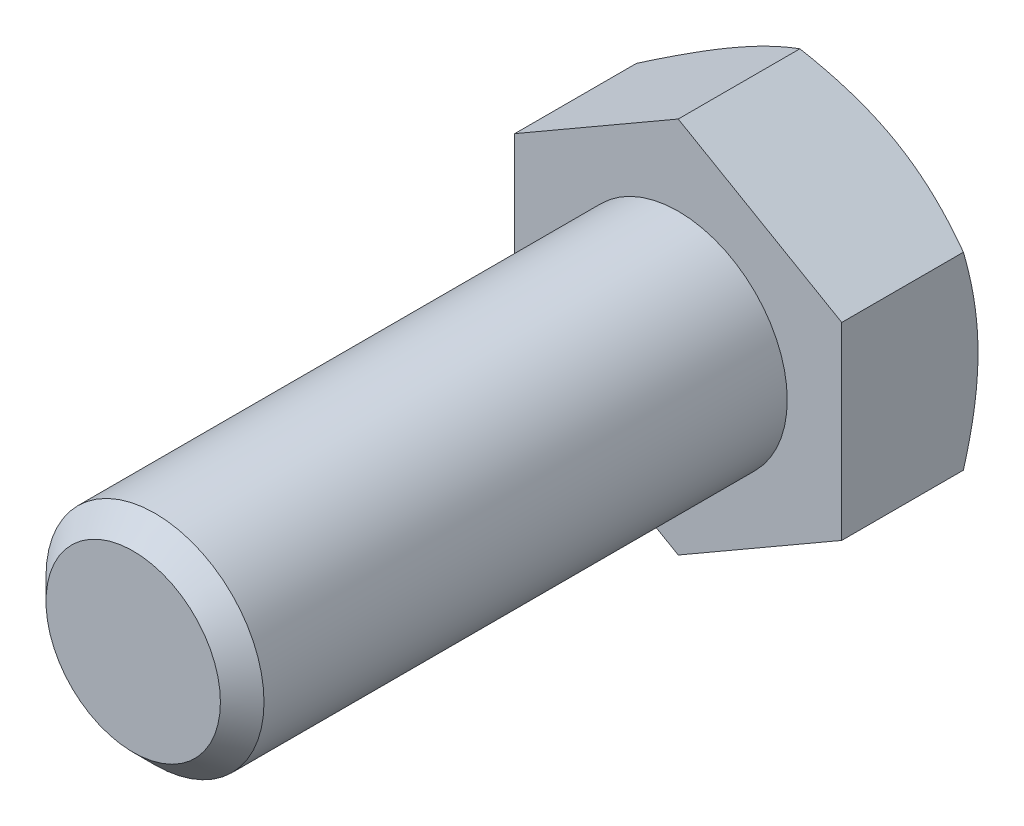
from build123d import *

# Parameters (mm, degrees)
ESQUISSE1_W        = 8
ESQUISSE1_H        = 40
CHANFREIN1_SIZE    = 1.6
BOSS_EXTRU_1_DEPTH = 10


with BuildPart() as part:
    # Esquisse1 → Base-R_volution (revolve)
    with BuildSketch(Plane(origin=(0, 0, 0), x_dir=(1, 0, 0), z_dir=(0, 1, 0))):
        with Locations((4, -20)):
            Rectangle(ESQUISSE1_W, ESQUISSE1_H)
    revolve(axis=Axis((0, 0, 0), (0, 0, 1)))

    # Chanfrein1
    chanfrein1_edges = [part.edges().sort_by_distance(p)[0] for p in [
        (-8, 0, 40),
    ]]
    chamfer(chanfrein1_edges, length=CHANFREIN1_SIZE)

    # Esquisse6 → Boss.-Extru.1 (add)
    with BuildSketch(Plane.XY):
        Polygon((12, -6.92820323), (12, 6.92820323), (0, 13.856406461), (-12, 6.92820323), (-12, -6.92820323), (0, -13.856406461), align=None)
    extrude(amount=-BOSS_EXTRU_1_DEPTH)

    # Esquisse7 → Enl_vement de mati_re-R_volution1 (revolve, cut)
    with BuildSketch(Plane(origin=(0, 0, 0), x_dir=(1, 0, 0), z_dir=(0, 1, 0))):
        Polygon((-12, 10), (-29.320508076, 10), (-29.320508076, 0), align=None)
    revolve(axis=Axis((0, 0, -6.239446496), (0, 0, 1)), mode=Mode.SUBTRACT)


solid = part.part
